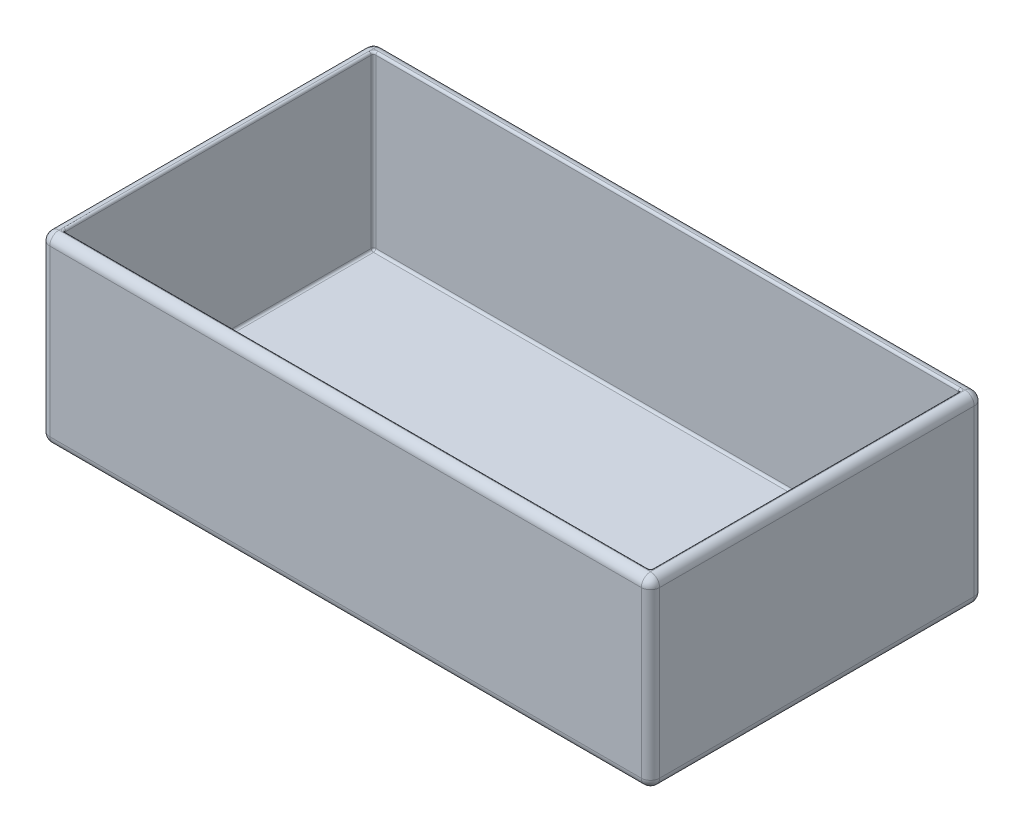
ISO-10303-21;
HEADER;
FILE_DESCRIPTION(('STEP AP214'),'2;1');
FILE_NAME('part.step','',(''),(''),'','','');
FILE_SCHEMA(('AUTOMOTIVE_DESIGN { 1 0 10303 214 1 1 1 1 }'));
ENDSEC;
DATA;
#1=APPLICATION_CONTEXT('core data for automotive mechanical design processes');
#2=APPLICATION_PROTOCOL_DEFINITION('international standard','automotive_design',2000,#1);
#3=PRODUCT_CONTEXT('',#1,'mechanical');
#4=PRODUCT('Part','Part','',(#3));
#5=PRODUCT_RELATED_PRODUCT_CATEGORY('part','',(#4));
#6=PRODUCT_DEFINITION_FORMATION('','',#4);
#7=PRODUCT_DEFINITION_CONTEXT('part definition',#1,'design');
#8=PRODUCT_DEFINITION('design','',#6,#7);
#9=PRODUCT_DEFINITION_SHAPE('','',#8);
#10=(LENGTH_UNIT() NAMED_UNIT(*) SI_UNIT(.MILLI.,.METRE.));
#11=(NAMED_UNIT(*) PLANE_ANGLE_UNIT() SI_UNIT($,.RADIAN.));
#12=(NAMED_UNIT(*) SI_UNIT($,.STERADIAN.) SOLID_ANGLE_UNIT());
#13=UNCERTAINTY_MEASURE_WITH_UNIT(LENGTH_MEASURE(1.E-05),#10,'distance_accuracy_value','');
#14=(GEOMETRIC_REPRESENTATION_CONTEXT(3) GLOBAL_UNCERTAINTY_ASSIGNED_CONTEXT((#13)) GLOBAL_UNIT_ASSIGNED_CONTEXT((#10,
#11,#12)) REPRESENTATION_CONTEXT('',''));
#15=CARTESIAN_POINT('',(0.,0.,0.));
#16=DIRECTION('',(0.,0.,1.));
#17=DIRECTION('',(1.,0.,0.));
#18=AXIS2_PLACEMENT_3D('',#15,#16,#17);
#19=CARTESIAN_POINT('',(0.,101.6,0.));
#20=DIRECTION('',(0.,1.,0.));
#21=DIRECTION('',(0.,0.,1.));
#22=AXIS2_PLACEMENT_3D('',#19,#20,#21);
#23=PLANE('',#22);
#24=CARTESIAN_POINT('',(-161.29,101.6,84.582));
#25=DIRECTION('',(0.,1.,0.));
#26=DIRECTION('',(0.,0.,1.));
#27=AXIS2_PLACEMENT_3D('',#24,#25,#26);
#28=CIRCLE('',#27,2.54);
#29=CARTESIAN_POINT('',(-163.83,101.6,84.582));
#30=VERTEX_POINT('',#29);
#31=CARTESIAN_POINT('',(-161.29,101.6,87.122));
#32=VERTEX_POINT('',#31);
#33=EDGE_CURVE('E290',#30,#32,#28,.T.);
#34=ORIENTED_EDGE('',*,*,#33,.F.);
#35=DIRECTION('',(0.,0.,1.));
#36=VECTOR('',#35,1.);
#37=CARTESIAN_POINT('',(-163.83,101.6,92.202));
#38=LINE('',#37,#36);
#39=CARTESIAN_POINT('',(-163.83,101.6,87.122));
#40=VERTEX_POINT('',#39);
#41=EDGE_CURVE('E252',#30,#40,#38,.T.);
#42=ORIENTED_EDGE('',*,*,#41,.T.);
#43=DIRECTION('',(1.,0.,0.));
#44=VECTOR('',#43,1.);
#45=CARTESIAN_POINT('',(168.91,101.6,87.122));
#46=LINE('',#45,#44);
#47=EDGE_CURVE('E255',#40,#32,#46,.T.);
#48=ORIENTED_EDGE('',*,*,#47,.T.);
#49=EDGE_LOOP('',(#34,#42,#48));
#50=FACE_BOUND('',#49,.T.);
#51=ADVANCED_FACE('F39',(#50),#23,.T.);
#52=CARTESIAN_POINT('',(161.29,101.6,84.582));
#53=DIRECTION('',(0.,1.,0.));
#54=DIRECTION('',(0.,0.,1.));
#55=AXIS2_PLACEMENT_3D('',#52,#53,#54);
#56=CIRCLE('',#55,2.54);
#57=CARTESIAN_POINT('',(161.29,101.6,87.122));
#58=VERTEX_POINT('',#57);
#59=CARTESIAN_POINT('',(163.83,101.6,84.582));
#60=VERTEX_POINT('',#59);
#61=EDGE_CURVE('E287',#58,#60,#56,.T.);
#62=ORIENTED_EDGE('',*,*,#61,.F.);
#63=CARTESIAN_POINT('',(163.83,101.6,87.122));
#64=VERTEX_POINT('',#63);
#65=EDGE_CURVE('E250',#58,#64,#46,.T.);
#66=ORIENTED_EDGE('',*,*,#65,.T.);
#67=DIRECTION('',(0.,0.,-1.));
#68=VECTOR('',#67,1.);
#69=CARTESIAN_POINT('',(163.83,101.6,-92.202));
#70=LINE('',#69,#68);
#71=EDGE_CURVE('E222',#64,#60,#70,.T.);
#72=ORIENTED_EDGE('',*,*,#71,.T.);
#73=EDGE_LOOP('',(#62,#66,#72));
#74=FACE_BOUND('',#73,.T.);
#75=ADVANCED_FACE('F624',(#74),#23,.T.);
#76=CARTESIAN_POINT('',(161.29,101.6,-84.582));
#77=DIRECTION('',(0.,1.,0.));
#78=DIRECTION('',(0.,0.,1.));
#79=AXIS2_PLACEMENT_3D('',#76,#77,#78);
#80=CIRCLE('',#79,2.54);
#81=CARTESIAN_POINT('',(163.83,101.6,-84.582));
#82=VERTEX_POINT('',#81);
#83=CARTESIAN_POINT('',(161.29,101.6,-87.122));
#84=VERTEX_POINT('',#83);
#85=EDGE_CURVE('E284',#82,#84,#80,.T.);
#86=ORIENTED_EDGE('',*,*,#85,.F.);
#87=CARTESIAN_POINT('',(163.83,101.6,-87.122));
#88=VERTEX_POINT('',#87);
#89=EDGE_CURVE('E645',#82,#88,#70,.T.);
#90=ORIENTED_EDGE('',*,*,#89,.T.);
#91=DIRECTION('',(-1.,0.,0.));
#92=VECTOR('',#91,1.);
#93=CARTESIAN_POINT('',(-168.91,101.6,-87.122));
#94=LINE('',#93,#92);
#95=EDGE_CURVE('E224',#88,#84,#94,.T.);
#96=ORIENTED_EDGE('',*,*,#95,.T.);
#97=EDGE_LOOP('',(#86,#90,#96));
#98=FACE_BOUND('',#97,.T.);
#99=ADVANCED_FACE('F630',(#98),#23,.T.);
#100=CARTESIAN_POINT('',(-161.29,101.6,-84.582));
#101=DIRECTION('',(0.,1.,0.));
#102=DIRECTION('',(0.,0.,1.));
#103=AXIS2_PLACEMENT_3D('',#100,#101,#102);
#104=CIRCLE('',#103,2.54);
#105=CARTESIAN_POINT('',(-161.29,101.6,-87.122));
#106=VERTEX_POINT('',#105);
#107=CARTESIAN_POINT('',(-163.83,101.6,-84.582));
#108=VERTEX_POINT('',#107);
#109=EDGE_CURVE('E218',#106,#108,#104,.T.);
#110=ORIENTED_EDGE('',*,*,#109,.F.);
#111=CARTESIAN_POINT('',(-163.83,101.6,-87.122));
#112=VERTEX_POINT('',#111);
#113=EDGE_CURVE('E212',#106,#112,#94,.T.);
#114=ORIENTED_EDGE('',*,*,#113,.T.);
#115=EDGE_CURVE('E216',#112,#108,#38,.T.);
#116=ORIENTED_EDGE('',*,*,#115,.T.);
#117=EDGE_LOOP('',(#110,#114,#116));
#118=FACE_BOUND('',#117,.T.);
#119=ADVANCED_FACE('F214',(#118),#23,.T.);
#120=CARTESIAN_POINT('',(168.91,101.6,-92.202));
#121=DIRECTION('',(-1.,0.,0.));
#122=DIRECTION('',(0.,0.,1.));
#123=AXIS2_PLACEMENT_3D('',#120,#121,#122);
#124=PLANE('',#123);
#125=DIRECTION('',(0.,-1.,0.));
#126=VECTOR('',#125,1.);
#127=CARTESIAN_POINT('',(168.91,101.6,-87.122));
#128=LINE('',#127,#126);
#129=CARTESIAN_POINT('',(168.91,5.08,-87.122));
#130=VERTEX_POINT('',#129);
#131=CARTESIAN_POINT('',(168.91,96.52,-87.122));
#132=VERTEX_POINT('',#131);
#133=EDGE_CURVE('E474',#130,#132,#128,.F.);
#134=ORIENTED_EDGE('',*,*,#133,.T.);
#135=DIRECTION('',(0.,0.,-1.));
#136=VECTOR('',#135,1.);
#137=CARTESIAN_POINT('',(168.91,96.52,92.202));
#138=LINE('',#137,#136);
#139=CARTESIAN_POINT('',(168.91,96.52,87.122));
#140=VERTEX_POINT('',#139);
#141=EDGE_CURVE('E476',#132,#140,#138,.F.);
#142=ORIENTED_EDGE('',*,*,#141,.T.);
#143=DIRECTION('',(0.,-1.,0.));
#144=VECTOR('',#143,1.);
#145=CARTESIAN_POINT('',(168.91,101.6,87.122));
#146=LINE('',#145,#144);
#147=CARTESIAN_POINT('',(168.91,5.08,87.122));
#148=VERTEX_POINT('',#147);
#149=EDGE_CURVE('E470',#140,#148,#146,.T.);
#150=ORIENTED_EDGE('',*,*,#149,.T.);
#151=DIRECTION('',(0.,0.,-1.));
#152=VECTOR('',#151,1.);
#153=CARTESIAN_POINT('',(168.91,5.08,-92.202));
#154=LINE('',#153,#152);
#155=EDGE_CURVE('E472',#148,#130,#154,.T.);
#156=ORIENTED_EDGE('',*,*,#155,.T.);
#157=EDGE_LOOP('',(#134,#142,#150,#156));
#158=FACE_BOUND('',#157,.T.);
#159=ADVANCED_FACE('F603',(#158),#124,.F.);
#160=CARTESIAN_POINT('',(-168.91,101.6,-92.202));
#161=DIRECTION('',(0.,0.,1.));
#162=DIRECTION('',(1.,0.,0.));
#163=AXIS2_PLACEMENT_3D('',#160,#161,#162);
#164=PLANE('',#163);
#165=DIRECTION('',(-1.,0.,0.));
#166=VECTOR('',#165,1.);
#167=CARTESIAN_POINT('',(168.91,96.52,-92.202));
#168=LINE('',#167,#166);
#169=CARTESIAN_POINT('',(-163.83,96.52,-92.202));
#170=VERTEX_POINT('',#169);
#171=CARTESIAN_POINT('',(163.83,96.52,-92.202));
#172=VERTEX_POINT('',#171);
#173=EDGE_CURVE('E231',#170,#172,#168,.F.);
#174=ORIENTED_EDGE('',*,*,#173,.T.);
#175=DIRECTION('',(0.,-1.,0.));
#176=VECTOR('',#175,1.);
#177=CARTESIAN_POINT('',(163.83,101.6,-92.202));
#178=LINE('',#177,#176);
#179=CARTESIAN_POINT('',(163.83,5.08,-92.202));
#180=VERTEX_POINT('',#179);
#181=EDGE_CURVE('E459',#172,#180,#178,.T.);
#182=ORIENTED_EDGE('',*,*,#181,.T.);
#183=DIRECTION('',(-1.,0.,0.));
#184=VECTOR('',#183,1.);
#185=CARTESIAN_POINT('',(-168.91,5.08,-92.202));
#186=LINE('',#185,#184);
#187=CARTESIAN_POINT('',(-163.83,5.08,-92.202));
#188=VERTEX_POINT('',#187);
#189=EDGE_CURVE('E456',#180,#188,#186,.T.);
#190=ORIENTED_EDGE('',*,*,#189,.T.);
#191=DIRECTION('',(0.,-1.,0.));
#192=VECTOR('',#191,1.);
#193=CARTESIAN_POINT('',(-163.83,101.6,-92.202));
#194=LINE('',#193,#192);
#195=EDGE_CURVE('E452',#188,#170,#194,.F.);
#196=ORIENTED_EDGE('',*,*,#195,.T.);
#197=EDGE_LOOP('',(#174,#182,#190,#196));
#198=FACE_BOUND('',#197,.T.);
#199=ADVANCED_FACE('F640',(#198),#164,.F.);
#200=CARTESIAN_POINT('',(-168.91,101.6,-92.202));
#201=DIRECTION('',(1.,0.,0.));
#202=DIRECTION('',(0.,0.,-1.));
#203=AXIS2_PLACEMENT_3D('',#200,#201,#202);
#204=PLANE('',#203);
#205=DIRECTION('',(0.,0.,1.));
#206=VECTOR('',#205,1.);
#207=CARTESIAN_POINT('',(-168.91,96.52,-92.202));
#208=LINE('',#207,#206);
#209=CARTESIAN_POINT('',(-168.91,96.52,87.122));
#210=VERTEX_POINT('',#209);
#211=CARTESIAN_POINT('',(-168.91,96.52,-87.122));
#212=VERTEX_POINT('',#211);
#213=EDGE_CURVE('E492',#210,#212,#208,.F.);
#214=ORIENTED_EDGE('',*,*,#213,.T.);
#215=DIRECTION('',(0.,-1.,0.));
#216=VECTOR('',#215,1.);
#217=CARTESIAN_POINT('',(-168.91,101.6,-87.122));
#218=LINE('',#217,#216);
#219=CARTESIAN_POINT('',(-168.91,5.08,-87.122));
#220=VERTEX_POINT('',#219);
#221=EDGE_CURVE('E276',#212,#220,#218,.T.);
#222=ORIENTED_EDGE('',*,*,#221,.T.);
#223=DIRECTION('',(0.,0.,1.));
#224=VECTOR('',#223,1.);
#225=CARTESIAN_POINT('',(-168.91,5.08,-92.202));
#226=LINE('',#225,#224);
#227=CARTESIAN_POINT('',(-168.91,5.08,87.122));
#228=VERTEX_POINT('',#227);
#229=EDGE_CURVE('E488',#220,#228,#226,.T.);
#230=ORIENTED_EDGE('',*,*,#229,.T.);
#231=DIRECTION('',(0.,-1.,0.));
#232=VECTOR('',#231,1.);
#233=CARTESIAN_POINT('',(-168.91,101.6,87.122));
#234=LINE('',#233,#232);
#235=EDGE_CURVE('E490',#228,#210,#234,.F.);
#236=ORIENTED_EDGE('',*,*,#235,.T.);
#237=EDGE_LOOP('',(#214,#222,#230,#236));
#238=FACE_BOUND('',#237,.T.);
#239=ADVANCED_FACE('F687',(#238),#204,.F.);
#240=CARTESIAN_POINT('',(-168.91,101.6,92.202));
#241=DIRECTION('',(0.,0.,-1.));
#242=DIRECTION('',(-1.,0.,0.));
#243=AXIS2_PLACEMENT_3D('',#240,#241,#242);
#244=PLANE('',#243);
#245=DIRECTION('',(0.,-1.,0.));
#246=VECTOR('',#245,1.);
#247=CARTESIAN_POINT('',(163.83,101.6,92.202));
#248=LINE('',#247,#246);
#249=CARTESIAN_POINT('',(163.83,5.08,92.202));
#250=VERTEX_POINT('',#249);
#251=CARTESIAN_POINT('',(163.83,96.52,92.202));
#252=VERTEX_POINT('',#251);
#253=EDGE_CURVE('E483',#250,#252,#248,.F.);
#254=ORIENTED_EDGE('',*,*,#253,.T.);
#255=DIRECTION('',(1.,0.,0.));
#256=VECTOR('',#255,1.);
#257=CARTESIAN_POINT('',(-168.91,96.52,92.202));
#258=LINE('',#257,#256);
#259=CARTESIAN_POINT('',(-163.83,96.52,92.202));
#260=VERTEX_POINT('',#259);
#261=EDGE_CURVE('E485',#252,#260,#258,.F.);
#262=ORIENTED_EDGE('',*,*,#261,.T.);
#263=DIRECTION('',(0.,-1.,0.));
#264=VECTOR('',#263,1.);
#265=CARTESIAN_POINT('',(-163.83,101.6,92.202));
#266=LINE('',#265,#264);
#267=CARTESIAN_POINT('',(-163.83,5.08,92.202));
#268=VERTEX_POINT('',#267);
#269=EDGE_CURVE('E479',#260,#268,#266,.T.);
#270=ORIENTED_EDGE('',*,*,#269,.T.);
#271=DIRECTION('',(1.,0.,0.));
#272=VECTOR('',#271,1.);
#273=CARTESIAN_POINT('',(-168.91,5.08,92.202));
#274=LINE('',#273,#272);
#275=EDGE_CURVE('E481',#268,#250,#274,.T.);
#276=ORIENTED_EDGE('',*,*,#275,.T.);
#277=EDGE_LOOP('',(#254,#262,#270,#276));
#278=FACE_BOUND('',#277,.T.);
#279=ADVANCED_FACE('F555',(#278),#244,.F.);
#280=CARTESIAN_POINT('',(0.,0.,0.));
#281=DIRECTION('',(0.,1.,0.));
#282=DIRECTION('',(0.,0.,1.));
#283=AXIS2_PLACEMENT_3D('',#280,#281,#282);
#284=PLANE('',#283);
#285=DIRECTION('',(0.,0.,1.));
#286=VECTOR('',#285,1.);
#287=CARTESIAN_POINT('',(-163.83,0.,0.));
#288=LINE('',#287,#286);
#289=CARTESIAN_POINT('',(-163.83,0.,87.122));
#290=VERTEX_POINT('',#289);
#291=CARTESIAN_POINT('',(-163.83,0.,-87.122));
#292=VERTEX_POINT('',#291);
#293=EDGE_CURVE('E461',#290,#292,#288,.F.);
#294=ORIENTED_EDGE('',*,*,#293,.T.);
#295=DIRECTION('',(-1.,0.,0.));
#296=VECTOR('',#295,1.);
#297=CARTESIAN_POINT('',(0.,0.,-87.122));
#298=LINE('',#297,#296);
#299=CARTESIAN_POINT('',(163.83,0.,-87.122));
#300=VERTEX_POINT('',#299);
#301=EDGE_CURVE('E467',#292,#300,#298,.F.);
#302=ORIENTED_EDGE('',*,*,#301,.T.);
#303=DIRECTION('',(0.,0.,-1.));
#304=VECTOR('',#303,1.);
#305=CARTESIAN_POINT('',(163.83,0.,0.));
#306=LINE('',#305,#304);
#307=CARTESIAN_POINT('',(163.83,0.,87.122));
#308=VERTEX_POINT('',#307);
#309=EDGE_CURVE('E465',#300,#308,#306,.F.);
#310=ORIENTED_EDGE('',*,*,#309,.T.);
#311=DIRECTION('',(1.,0.,0.));
#312=VECTOR('',#311,1.);
#313=CARTESIAN_POINT('',(0.,0.,87.122));
#314=LINE('',#313,#312);
#315=EDGE_CURVE('E463',#308,#290,#314,.F.);
#316=ORIENTED_EDGE('',*,*,#315,.T.);
#317=EDGE_LOOP('',(#294,#302,#310,#316));
#318=FACE_BOUND('',#317,.T.);
#319=ADVANCED_FACE('F586',(#318),#284,.F.);
#320=CARTESIAN_POINT('',(162.56,101.6,-92.202));
#321=DIRECTION('',(-1.,0.,0.));
#322=DIRECTION('',(0.,0.,1.));
#323=AXIS2_PLACEMENT_3D('',#320,#321,#322);
#324=PLANE('',#323);
#325=DIRECTION('',(0.,-1.,0.));
#326=VECTOR('',#325,1.);
#327=CARTESIAN_POINT('',(162.56,101.6,84.582));
#328=LINE('',#327,#326);
#329=CARTESIAN_POINT('',(162.56,7.62,84.582));
#330=VERTEX_POINT('',#329);
#331=CARTESIAN_POINT('',(162.56,100.33,84.582));
#332=VERTEX_POINT('',#331);
#333=EDGE_CURVE('E297',#330,#332,#328,.F.);
#334=ORIENTED_EDGE('',*,*,#333,.T.);
#335=DIRECTION('',(0.,0.,-1.));
#336=VECTOR('',#335,1.);
#337=CARTESIAN_POINT('',(162.56,100.33,-92.202));
#338=LINE('',#337,#336);
#339=CARTESIAN_POINT('',(162.56,100.33,-84.582));
#340=VERTEX_POINT('',#339);
#341=EDGE_CURVE('E299',#332,#340,#338,.T.);
#342=ORIENTED_EDGE('',*,*,#341,.T.);
#343=DIRECTION('',(0.,-1.,0.));
#344=VECTOR('',#343,1.);
#345=CARTESIAN_POINT('',(162.56,6.34999999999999,-84.582));
#346=LINE('',#345,#344);
#347=CARTESIAN_POINT('',(162.56,7.62,-84.582));
#348=VERTEX_POINT('',#347);
#349=EDGE_CURVE('E295',#340,#348,#346,.T.);
#350=ORIENTED_EDGE('',*,*,#349,.T.);
#351=DIRECTION('',(0.,0.,-1.));
#352=VECTOR('',#351,1.);
#353=CARTESIAN_POINT('',(162.56,7.62,85.852));
#354=LINE('',#353,#352);
#355=EDGE_CURVE('E293',#348,#330,#354,.F.);
#356=ORIENTED_EDGE('',*,*,#355,.T.);
#357=EDGE_LOOP('',(#334,#342,#350,#356));
#358=FACE_BOUND('',#357,.T.);
#359=ADVANCED_FACE('F678',(#358),#324,.T.);
#360=CARTESIAN_POINT('',(-168.91,101.6,-85.852));
#361=DIRECTION('',(0.,0.,1.));
#362=DIRECTION('',(1.,0.,0.));
#363=AXIS2_PLACEMENT_3D('',#360,#361,#362);
#364=PLANE('',#363);
#365=DIRECTION('',(0.,-1.,0.));
#366=VECTOR('',#365,1.);
#367=CARTESIAN_POINT('',(161.29,101.6,-85.852));
#368=LINE('',#367,#366);
#369=CARTESIAN_POINT('',(161.29,7.62,-85.852));
#370=VERTEX_POINT('',#369);
#371=CARTESIAN_POINT('',(161.29,100.33,-85.852));
#372=VERTEX_POINT('',#371);
#373=EDGE_CURVE('E306',#370,#372,#368,.F.);
#374=ORIENTED_EDGE('',*,*,#373,.T.);
#375=DIRECTION('',(-1.,0.,0.));
#376=VECTOR('',#375,1.);
#377=CARTESIAN_POINT('',(-168.91,100.33,-85.852));
#378=LINE('',#377,#376);
#379=CARTESIAN_POINT('',(-161.29,100.33,-85.852));
#380=VERTEX_POINT('',#379);
#381=EDGE_CURVE('E308',#372,#380,#378,.T.);
#382=ORIENTED_EDGE('',*,*,#381,.T.);
#383=DIRECTION('',(0.,-1.,0.));
#384=VECTOR('',#383,1.);
#385=CARTESIAN_POINT('',(-161.29,6.34999999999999,-85.852));
#386=LINE('',#385,#384);
#387=CARTESIAN_POINT('',(-161.29,7.62,-85.852));
#388=VERTEX_POINT('',#387);
#389=EDGE_CURVE('E302',#380,#388,#386,.T.);
#390=ORIENTED_EDGE('',*,*,#389,.T.);
#391=DIRECTION('',(-1.,0.,0.));
#392=VECTOR('',#391,1.);
#393=CARTESIAN_POINT('',(162.56,7.62,-85.852));
#394=LINE('',#393,#392);
#395=EDGE_CURVE('E304',#388,#370,#394,.F.);
#396=ORIENTED_EDGE('',*,*,#395,.T.);
#397=EDGE_LOOP('',(#374,#382,#390,#396));
#398=FACE_BOUND('',#397,.T.);
#399=ADVANCED_FACE('F446',(#398),#364,.T.);
#400=CARTESIAN_POINT('',(-162.56,101.6,-92.202));
#401=DIRECTION('',(1.,0.,0.));
#402=DIRECTION('',(0.,0.,-1.));
#403=AXIS2_PLACEMENT_3D('',#400,#401,#402);
#404=PLANE('',#403);
#405=DIRECTION('',(0.,0.,1.));
#406=VECTOR('',#405,1.);
#407=CARTESIAN_POINT('',(-162.56,100.33,-92.202));
#408=LINE('',#407,#406);
#409=CARTESIAN_POINT('',(-162.56,100.33,-84.582));
#410=VERTEX_POINT('',#409);
#411=CARTESIAN_POINT('',(-162.56,100.33,84.582));
#412=VERTEX_POINT('',#411);
#413=EDGE_CURVE('E48',#410,#412,#408,.T.);
#414=ORIENTED_EDGE('',*,*,#413,.T.);
#415=DIRECTION('',(0.,-1.,0.));
#416=VECTOR('',#415,1.);
#417=CARTESIAN_POINT('',(-162.56,6.34999999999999,84.582));
#418=LINE('',#417,#416);
#419=CARTESIAN_POINT('',(-162.56,7.62,84.582));
#420=VERTEX_POINT('',#419);
#421=EDGE_CURVE('E11',#412,#420,#418,.T.);
#422=ORIENTED_EDGE('',*,*,#421,.T.);
#423=DIRECTION('',(0.,0.,1.));
#424=VECTOR('',#423,1.);
#425=CARTESIAN_POINT('',(-162.56,7.62,-85.852));
#426=LINE('',#425,#424);
#427=CARTESIAN_POINT('',(-162.56,7.62,-84.582));
#428=VERTEX_POINT('',#427);
#429=EDGE_CURVE('E320',#420,#428,#426,.F.);
#430=ORIENTED_EDGE('',*,*,#429,.T.);
#431=DIRECTION('',(0.,-1.,0.));
#432=VECTOR('',#431,1.);
#433=CARTESIAN_POINT('',(-162.56,101.6,-84.582));
#434=LINE('',#433,#432);
#435=EDGE_CURVE('E59',#428,#410,#434,.F.);
#436=ORIENTED_EDGE('',*,*,#435,.T.);
#437=EDGE_LOOP('',(#414,#422,#430,#436));
#438=FACE_BOUND('',#437,.T.);
#439=ADVANCED_FACE('F418',(#438),#404,.T.);
#440=CARTESIAN_POINT('',(-168.91,101.6,85.852));
#441=DIRECTION('',(0.,0.,-1.));
#442=DIRECTION('',(-1.,0.,0.));
#443=AXIS2_PLACEMENT_3D('',#440,#441,#442);
#444=PLANE('',#443);
#445=DIRECTION('',(0.,-1.,0.));
#446=VECTOR('',#445,1.);
#447=CARTESIAN_POINT('',(-161.29,101.6,85.852));
#448=LINE('',#447,#446);
#449=CARTESIAN_POINT('',(-161.29,7.62,85.852));
#450=VERTEX_POINT('',#449);
#451=CARTESIAN_POINT('',(-161.29,100.33,85.852));
#452=VERTEX_POINT('',#451);
#453=EDGE_CURVE('E273',#450,#452,#448,.F.);
#454=ORIENTED_EDGE('',*,*,#453,.T.);
#455=DIRECTION('',(1.,0.,0.));
#456=VECTOR('',#455,1.);
#457=CARTESIAN_POINT('',(-168.91,100.33,85.852));
#458=LINE('',#457,#456);
#459=CARTESIAN_POINT('',(161.29,100.33,85.852));
#460=VERTEX_POINT('',#459);
#461=EDGE_CURVE('E280',#452,#460,#458,.T.);
#462=ORIENTED_EDGE('',*,*,#461,.T.);
#463=DIRECTION('',(0.,-1.,0.));
#464=VECTOR('',#463,1.);
#465=CARTESIAN_POINT('',(161.29,6.34999999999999,85.852));
#466=LINE('',#465,#464);
#467=CARTESIAN_POINT('',(161.29,7.62,85.852));
#468=VERTEX_POINT('',#467);
#469=EDGE_CURVE('E278',#460,#468,#466,.T.);
#470=ORIENTED_EDGE('',*,*,#469,.T.);
#471=DIRECTION('',(1.,0.,0.));
#472=VECTOR('',#471,1.);
#473=CARTESIAN_POINT('',(-162.56,7.62,85.852));
#474=LINE('',#473,#472);
#475=EDGE_CURVE('E275',#468,#450,#474,.F.);
#476=ORIENTED_EDGE('',*,*,#475,.T.);
#477=EDGE_LOOP('',(#454,#462,#470,#476));
#478=FACE_BOUND('',#477,.T.);
#479=ADVANCED_FACE('F667',(#478),#444,.T.);
#480=CARTESIAN_POINT('',(0.,6.35,0.));
#481=DIRECTION('',(0.,1.,0.));
#482=DIRECTION('',(0.,0.,1.));
#483=AXIS2_PLACEMENT_3D('',#480,#481,#482);
#484=PLANE('',#483);
#485=DIRECTION('',(1.,0.,0.));
#486=VECTOR('',#485,1.);
#487=CARTESIAN_POINT('',(162.56,6.35,84.582));
#488=LINE('',#487,#486);
#489=CARTESIAN_POINT('',(-161.29,6.35,84.582));
#490=VERTEX_POINT('',#489);
#491=CARTESIAN_POINT('',(161.29,6.35,84.582));
#492=VERTEX_POINT('',#491);
#493=EDGE_CURVE('E315',#490,#492,#488,.T.);
#494=ORIENTED_EDGE('',*,*,#493,.T.);
#495=DIRECTION('',(0.,0.,-1.));
#496=VECTOR('',#495,1.);
#497=CARTESIAN_POINT('',(161.29,6.35,-85.852));
#498=LINE('',#497,#496);
#499=CARTESIAN_POINT('',(161.29,6.35,-84.582));
#500=VERTEX_POINT('',#499);
#501=EDGE_CURVE('E318',#492,#500,#498,.T.);
#502=ORIENTED_EDGE('',*,*,#501,.T.);
#503=DIRECTION('',(-1.,0.,0.));
#504=VECTOR('',#503,1.);
#505=CARTESIAN_POINT('',(-162.56,6.35,-84.582));
#506=LINE('',#505,#504);
#507=CARTESIAN_POINT('',(-161.29,6.35,-84.582));
#508=VERTEX_POINT('',#507);
#509=EDGE_CURVE('E313',#500,#508,#506,.T.);
#510=ORIENTED_EDGE('',*,*,#509,.T.);
#511=DIRECTION('',(0.,0.,1.));
#512=VECTOR('',#511,1.);
#513=CARTESIAN_POINT('',(-161.29,6.35,85.852));
#514=LINE('',#513,#512);
#515=EDGE_CURVE('E311',#508,#490,#514,.T.);
#516=ORIENTED_EDGE('',*,*,#515,.T.);
#517=EDGE_LOOP('',(#494,#502,#510,#516));
#518=FACE_BOUND('',#517,.T.);
#519=ADVANCED_FACE('F425',(#518),#484,.T.);
#520=CARTESIAN_POINT('',(-168.91,5.08,87.122));
#521=DIRECTION('',(1.,0.,0.));
#522=DIRECTION('',(0.,0.,-1.));
#523=AXIS2_PLACEMENT_3D('',#520,#521,#522);
#524=CYLINDRICAL_SURFACE('',#523,5.08);
#525=CARTESIAN_POINT('',(163.83,5.08,87.122));
#526=DIRECTION('',(1.,0.,0.));
#527=DIRECTION('',(0.,0.,-1.));
#528=AXIS2_PLACEMENT_3D('',#525,#526,#527);
#529=CIRCLE('',#528,5.08);
#530=EDGE_CURVE('E256',#250,#308,#529,.T.);
#531=ORIENTED_EDGE('',*,*,#530,.F.);
#532=ORIENTED_EDGE('',*,*,#275,.F.);
#533=CARTESIAN_POINT('',(-163.83,5.08,87.122));
#534=DIRECTION('',(-1.,0.,0.));
#535=DIRECTION('',(0.,0.,1.));
#536=AXIS2_PLACEMENT_3D('',#533,#534,#535);
#537=CIRCLE('',#536,5.08);
#538=EDGE_CURVE('E261',#290,#268,#537,.T.);
#539=ORIENTED_EDGE('',*,*,#538,.F.);
#540=ORIENTED_EDGE('',*,*,#315,.F.);
#541=EDGE_LOOP('',(#531,#532,#539,#540));
#542=FACE_BOUND('',#541,.T.);
#543=ADVANCED_FACE('F574',(#542),#524,.T.);
#544=CARTESIAN_POINT('',(163.83,5.08,87.122));
#545=DIRECTION('',(0.,-1.,0.));
#546=DIRECTION('',(0.,0.,-1.));
#547=AXIS2_PLACEMENT_3D('',#544,#545,#546);
#548=SPHERICAL_SURFACE('',#547,5.08);
#549=CARTESIAN_POINT('',(163.83,5.08,87.122));
#550=DIRECTION('',(0.,-1.,0.));
#551=DIRECTION('',(0.,0.,-1.));
#552=AXIS2_PLACEMENT_3D('',#549,#550,#551);
#553=CIRCLE('',#552,5.08);
#554=EDGE_CURVE('E540',#250,#148,#553,.F.);
#555=ORIENTED_EDGE('',*,*,#554,.F.);
#556=ORIENTED_EDGE('',*,*,#530,.T.);
#557=CARTESIAN_POINT('',(163.83,5.08,87.122));
#558=DIRECTION('',(0.,0.,1.));
#559=DIRECTION('',(1.,0.,0.));
#560=AXIS2_PLACEMENT_3D('',#557,#558,#559);
#561=CIRCLE('',#560,5.08);
#562=EDGE_CURVE('E269',#148,#308,#561,.F.);
#563=ORIENTED_EDGE('',*,*,#562,.F.);
#564=EDGE_LOOP('',(#555,#556,#563));
#565=FACE_BOUND('',#564,.T.);
#566=ADVANCED_FACE('F547',(#565),#548,.T.);
#567=CARTESIAN_POINT('',(-163.83,5.08,87.122));
#568=DIRECTION('',(0.,0.,1.));
#569=DIRECTION('',(0.,-1.,0.));
#570=AXIS2_PLACEMENT_3D('',#567,#568,#569);
#571=SPHERICAL_SURFACE('',#570,5.08);
#572=CARTESIAN_POINT('',(-163.83,5.08,87.122));
#573=DIRECTION('',(0.,0.,1.));
#574=DIRECTION('',(1.,0.,0.));
#575=AXIS2_PLACEMENT_3D('',#572,#573,#574);
#576=CIRCLE('',#575,5.08);
#577=EDGE_CURVE('E534',#290,#228,#576,.F.);
#578=ORIENTED_EDGE('',*,*,#577,.F.);
#579=ORIENTED_EDGE('',*,*,#538,.T.);
#580=CARTESIAN_POINT('',(-163.83,5.08,87.122));
#581=DIRECTION('',(0.,-1.,0.));
#582=DIRECTION('',(0.,0.,-1.));
#583=AXIS2_PLACEMENT_3D('',#580,#581,#582);
#584=CIRCLE('',#583,5.08);
#585=EDGE_CURVE('E537',#228,#268,#584,.F.);
#586=ORIENTED_EDGE('',*,*,#585,.F.);
#587=EDGE_LOOP('',(#578,#579,#586));
#588=FACE_BOUND('',#587,.T.);
#589=ADVANCED_FACE('F578',(#588),#571,.T.);
#590=CARTESIAN_POINT('',(163.83,5.08,-92.202));
#591=DIRECTION('',(0.,0.,-1.));
#592=DIRECTION('',(-1.,0.,0.));
#593=AXIS2_PLACEMENT_3D('',#590,#591,#592);
#594=CYLINDRICAL_SURFACE('',#593,5.08);
#595=ORIENTED_EDGE('',*,*,#562,.T.);
#596=ORIENTED_EDGE('',*,*,#309,.F.);
#597=CARTESIAN_POINT('',(163.83,5.08,-87.122));
#598=DIRECTION('',(0.,0.,-1.));
#599=DIRECTION('',(-1.,0.,0.));
#600=AXIS2_PLACEMENT_3D('',#597,#598,#599);
#601=CIRCLE('',#600,5.08);
#602=EDGE_CURVE('E529',#130,#300,#601,.T.);
#603=ORIENTED_EDGE('',*,*,#602,.F.);
#604=ORIENTED_EDGE('',*,*,#155,.F.);
#605=EDGE_LOOP('',(#595,#596,#603,#604));
#606=FACE_BOUND('',#605,.T.);
#607=ADVANCED_FACE('F545',(#606),#594,.T.);
#608=CARTESIAN_POINT('',(163.83,101.6,87.122));
#609=DIRECTION('',(0.,-1.,0.));
#610=DIRECTION('',(0.,0.,-1.));
#611=AXIS2_PLACEMENT_3D('',#608,#609,#610);
#612=CYLINDRICAL_SURFACE('',#611,5.08);
#613=ORIENTED_EDGE('',*,*,#554,.T.);
#614=ORIENTED_EDGE('',*,*,#149,.F.);
#615=CARTESIAN_POINT('',(163.83,96.52,87.122));
#616=DIRECTION('',(0.,1.,0.));
#617=DIRECTION('',(0.,0.,1.));
#618=AXIS2_PLACEMENT_3D('',#615,#616,#617);
#619=CIRCLE('',#618,5.08);
#620=EDGE_CURVE('E526',#252,#140,#619,.T.);
#621=ORIENTED_EDGE('',*,*,#620,.F.);
#622=ORIENTED_EDGE('',*,*,#253,.F.);
#623=EDGE_LOOP('',(#613,#614,#621,#622));
#624=FACE_BOUND('',#623,.T.);
#625=ADVANCED_FACE('F552',(#624),#612,.T.);
#626=CARTESIAN_POINT('',(0.,96.52,87.122));
#627=DIRECTION('',(-1.,0.,0.));
#628=DIRECTION('',(0.,0.,1.));
#629=AXIS2_PLACEMENT_3D('',#626,#627,#628);
#630=CYLINDRICAL_SURFACE('',#629,5.08);
#631=CARTESIAN_POINT('',(-163.83,96.52,87.122));
#632=DIRECTION('',(-1.,0.,0.));
#633=DIRECTION('',(0.,0.,1.));
#634=AXIS2_PLACEMENT_3D('',#631,#632,#633);
#635=CIRCLE('',#634,5.08);
#636=EDGE_CURVE('E520',#260,#40,#635,.T.);
#637=ORIENTED_EDGE('',*,*,#636,.F.);
#638=ORIENTED_EDGE('',*,*,#261,.F.);
#639=CARTESIAN_POINT('',(163.83,96.52,87.122));
#640=DIRECTION('',(1.,0.,0.));
#641=DIRECTION('',(0.,0.,-1.));
#642=AXIS2_PLACEMENT_3D('',#639,#640,#641);
#643=CIRCLE('',#642,5.08);
#644=EDGE_CURVE('E523',#64,#252,#643,.T.);
#645=ORIENTED_EDGE('',*,*,#644,.F.);
#646=ORIENTED_EDGE('',*,*,#65,.F.);
#647=EDGE_CURVE('E253',#32,#58,#46,.T.);
#648=ORIENTED_EDGE('',*,*,#647,.F.);
#649=ORIENTED_EDGE('',*,*,#47,.F.);
#650=EDGE_LOOP('',(#637,#638,#645,#646,#648,#649));
#651=FACE_BOUND('',#650,.T.);
#652=ADVANCED_FACE('F560',(#651),#630,.T.);
#653=CARTESIAN_POINT('',(-163.83,101.6,87.122));
#654=DIRECTION('',(0.,-1.,0.));
#655=DIRECTION('',(0.,0.,-1.));
#656=AXIS2_PLACEMENT_3D('',#653,#654,#655);
#657=CYLINDRICAL_SURFACE('',#656,5.08);
#658=ORIENTED_EDGE('',*,*,#585,.T.);
#659=ORIENTED_EDGE('',*,*,#269,.F.);
#660=CARTESIAN_POINT('',(-163.83,96.52,87.122));
#661=DIRECTION('',(0.,1.,0.));
#662=DIRECTION('',(0.,0.,1.));
#663=AXIS2_PLACEMENT_3D('',#660,#661,#662);
#664=CIRCLE('',#663,5.08);
#665=EDGE_CURVE('E518',#210,#260,#664,.T.);
#666=ORIENTED_EDGE('',*,*,#665,.F.);
#667=ORIENTED_EDGE('',*,*,#235,.F.);
#668=EDGE_LOOP('',(#658,#659,#666,#667));
#669=FACE_BOUND('',#668,.T.);
#670=ADVANCED_FACE('F569',(#669),#657,.T.);
#671=CARTESIAN_POINT('',(-163.83,5.08,-92.202));
#672=DIRECTION('',(0.,0.,1.));
#673=DIRECTION('',(1.,0.,0.));
#674=AXIS2_PLACEMENT_3D('',#671,#672,#673);
#675=CYLINDRICAL_SURFACE('',#674,5.08);
#676=ORIENTED_EDGE('',*,*,#577,.T.);
#677=ORIENTED_EDGE('',*,*,#229,.F.);
#678=CARTESIAN_POINT('',(-163.83,5.08,-87.122));
#679=DIRECTION('',(0.,0.,-1.));
#680=DIRECTION('',(-1.,0.,0.));
#681=AXIS2_PLACEMENT_3D('',#678,#679,#680);
#682=CIRCLE('',#681,5.08);
#683=EDGE_CURVE('E515',#292,#220,#682,.T.);
#684=ORIENTED_EDGE('',*,*,#683,.F.);
#685=ORIENTED_EDGE('',*,*,#293,.F.);
#686=EDGE_LOOP('',(#676,#677,#684,#685));
#687=FACE_BOUND('',#686,.T.);
#688=ADVANCED_FACE('F583',(#687),#675,.T.);
#689=CARTESIAN_POINT('',(-168.91,5.08,-87.122));
#690=DIRECTION('',(-1.,0.,0.));
#691=DIRECTION('',(0.,0.,1.));
#692=AXIS2_PLACEMENT_3D('',#689,#690,#691);
#693=CYLINDRICAL_SURFACE('',#692,5.08);
#694=CARTESIAN_POINT('',(163.83,5.08,-87.122));
#695=DIRECTION('',(1.,0.,0.));
#696=DIRECTION('',(0.,0.,-1.));
#697=AXIS2_PLACEMENT_3D('',#694,#695,#696);
#698=CIRCLE('',#697,5.08);
#699=EDGE_CURVE('E531',#300,#180,#698,.T.);
#700=ORIENTED_EDGE('',*,*,#699,.F.);
#701=ORIENTED_EDGE('',*,*,#301,.F.);
#702=CARTESIAN_POINT('',(-163.83,5.08,-87.122));
#703=DIRECTION('',(-1.,0.,0.));
#704=DIRECTION('',(0.,0.,1.));
#705=AXIS2_PLACEMENT_3D('',#702,#703,#704);
#706=CIRCLE('',#705,5.08);
#707=EDGE_CURVE('E512',#188,#292,#706,.T.);
#708=ORIENTED_EDGE('',*,*,#707,.F.);
#709=ORIENTED_EDGE('',*,*,#189,.F.);
#710=EDGE_LOOP('',(#700,#701,#708,#709));
#711=FACE_BOUND('',#710,.T.);
#712=ADVANCED_FACE('F590',(#711),#693,.T.);
#713=CARTESIAN_POINT('',(163.83,5.08,-87.122));
#714=DIRECTION('',(0.,-1.,0.));
#715=DIRECTION('',(0.,0.,-1.));
#716=AXIS2_PLACEMENT_3D('',#713,#714,#715);
#717=SPHERICAL_SURFACE('',#716,5.08);
#718=ORIENTED_EDGE('',*,*,#602,.T.);
#719=ORIENTED_EDGE('',*,*,#699,.T.);
#720=CARTESIAN_POINT('',(163.83,5.08,-87.122));
#721=DIRECTION('',(0.,-1.,0.));
#722=DIRECTION('',(0.,0.,-1.));
#723=AXIS2_PLACEMENT_3D('',#720,#721,#722);
#724=CIRCLE('',#723,5.08);
#725=EDGE_CURVE('E509',#130,#180,#724,.F.);
#726=ORIENTED_EDGE('',*,*,#725,.F.);
#727=EDGE_LOOP('',(#718,#719,#726));
#728=FACE_BOUND('',#727,.T.);
#729=ADVANCED_FACE('F595',(#728),#717,.T.);
#730=CARTESIAN_POINT('',(163.83,96.52,87.122));
#731=DIRECTION('',(0.,0.,1.));
#732=DIRECTION('',(1.,0.,0.));
#733=AXIS2_PLACEMENT_3D('',#730,#731,#732);
#734=SPHERICAL_SURFACE('',#733,5.08);
#735=ORIENTED_EDGE('',*,*,#644,.T.);
#736=ORIENTED_EDGE('',*,*,#620,.T.);
#737=CARTESIAN_POINT('',(163.83,96.52,87.122));
#738=DIRECTION('',(0.,0.,1.));
#739=DIRECTION('',(1.,0.,0.));
#740=AXIS2_PLACEMENT_3D('',#737,#738,#739);
#741=CIRCLE('',#740,5.08);
#742=EDGE_CURVE('E507',#64,#140,#741,.F.);
#743=ORIENTED_EDGE('',*,*,#742,.F.);
#744=EDGE_LOOP('',(#735,#736,#743));
#745=FACE_BOUND('',#744,.T.);
#746=ADVANCED_FACE('F612',(#745),#734,.T.);
#747=CARTESIAN_POINT('',(-163.83,96.52,87.122));
#748=DIRECTION('',(0.,0.,1.));
#749=DIRECTION('',(1.,0.,0.));
#750=AXIS2_PLACEMENT_3D('',#747,#748,#749);
#751=SPHERICAL_SURFACE('',#750,5.08);
#752=ORIENTED_EDGE('',*,*,#665,.T.);
#753=ORIENTED_EDGE('',*,*,#636,.T.);
#754=CARTESIAN_POINT('',(-163.83,96.52,87.122));
#755=DIRECTION('',(0.,0.,1.));
#756=DIRECTION('',(1.,0.,0.));
#757=AXIS2_PLACEMENT_3D('',#754,#755,#756);
#758=CIRCLE('',#757,5.08);
#759=EDGE_CURVE('E505',#210,#40,#758,.F.);
#760=ORIENTED_EDGE('',*,*,#759,.F.);
#761=EDGE_LOOP('',(#752,#753,#760));
#762=FACE_BOUND('',#761,.T.);
#763=ADVANCED_FACE('F614',(#762),#751,.T.);
#764=CARTESIAN_POINT('',(-163.83,5.08,-87.122));
#765=DIRECTION('',(0.,-1.,0.));
#766=DIRECTION('',(0.,0.,-1.));
#767=AXIS2_PLACEMENT_3D('',#764,#765,#766);
#768=SPHERICAL_SURFACE('',#767,5.08);
#769=ORIENTED_EDGE('',*,*,#707,.T.);
#770=ORIENTED_EDGE('',*,*,#683,.T.);
#771=CARTESIAN_POINT('',(-163.83,5.08,-87.122));
#772=DIRECTION('',(0.,-1.,0.));
#773=DIRECTION('',(0.,0.,-1.));
#774=AXIS2_PLACEMENT_3D('',#771,#772,#773);
#775=CIRCLE('',#774,5.08);
#776=EDGE_CURVE('E503',#188,#220,#775,.F.);
#777=ORIENTED_EDGE('',*,*,#776,.F.);
#778=EDGE_LOOP('',(#769,#770,#777));
#779=FACE_BOUND('',#778,.T.);
#780=ADVANCED_FACE('F620',(#779),#768,.T.);
#781=CARTESIAN_POINT('',(163.83,101.6,-87.122));
#782=DIRECTION('',(0.,-1.,0.));
#783=DIRECTION('',(0.,0.,-1.));
#784=AXIS2_PLACEMENT_3D('',#781,#782,#783);
#785=CYLINDRICAL_SURFACE('',#784,5.08);
#786=ORIENTED_EDGE('',*,*,#725,.T.);
#787=ORIENTED_EDGE('',*,*,#181,.F.);
#788=CARTESIAN_POINT('',(163.83,96.52,-87.122));
#789=DIRECTION('',(0.,1.,0.));
#790=DIRECTION('',(0.,0.,1.));
#791=AXIS2_PLACEMENT_3D('',#788,#789,#790);
#792=CIRCLE('',#791,5.08);
#793=EDGE_CURVE('E500',#132,#172,#792,.T.);
#794=ORIENTED_EDGE('',*,*,#793,.F.);
#795=ORIENTED_EDGE('',*,*,#133,.F.);
#796=EDGE_LOOP('',(#786,#787,#794,#795));
#797=FACE_BOUND('',#796,.T.);
#798=ADVANCED_FACE('F599',(#797),#785,.T.);
#799=CARTESIAN_POINT('',(163.83,96.52,0.));
#800=DIRECTION('',(0.,0.,1.));
#801=DIRECTION('',(1.,0.,0.));
#802=AXIS2_PLACEMENT_3D('',#799,#800,#801);
#803=CYLINDRICAL_SURFACE('',#802,5.08);
#804=ORIENTED_EDGE('',*,*,#742,.T.);
#805=ORIENTED_EDGE('',*,*,#141,.F.);
#806=CARTESIAN_POINT('',(163.83,96.52,-87.122));
#807=DIRECTION('',(0.,0.,-1.));
#808=DIRECTION('',(-1.,0.,0.));
#809=AXIS2_PLACEMENT_3D('',#806,#807,#808);
#810=CIRCLE('',#809,5.08);
#811=EDGE_CURVE('E243',#88,#132,#810,.T.);
#812=ORIENTED_EDGE('',*,*,#811,.F.);
#813=ORIENTED_EDGE('',*,*,#89,.F.);
#814=EDGE_CURVE('E649',#60,#82,#70,.T.);
#815=ORIENTED_EDGE('',*,*,#814,.F.);
#816=ORIENTED_EDGE('',*,*,#71,.F.);
#817=EDGE_LOOP('',(#804,#805,#812,#813,#815,#816));
#818=FACE_BOUND('',#817,.T.);
#819=ADVANCED_FACE('F606',(#818),#803,.T.);
#820=CARTESIAN_POINT('',(-163.83,96.52,0.));
#821=DIRECTION('',(0.,0.,-1.));
#822=DIRECTION('',(-1.,0.,0.));
#823=AXIS2_PLACEMENT_3D('',#820,#821,#822);
#824=CYLINDRICAL_SURFACE('',#823,5.08);
#825=ORIENTED_EDGE('',*,*,#759,.T.);
#826=ORIENTED_EDGE('',*,*,#41,.F.);
#827=EDGE_CURVE('E249',#108,#30,#38,.T.);
#828=ORIENTED_EDGE('',*,*,#827,.F.);
#829=ORIENTED_EDGE('',*,*,#115,.F.);
#830=CARTESIAN_POINT('',(-163.83,96.52,-87.122));
#831=DIRECTION('',(0.,0.,-1.));
#832=DIRECTION('',(-1.,0.,0.));
#833=AXIS2_PLACEMENT_3D('',#830,#831,#832);
#834=CIRCLE('',#833,5.08);
#835=EDGE_CURVE('E237',#212,#112,#834,.T.);
#836=ORIENTED_EDGE('',*,*,#835,.F.);
#837=ORIENTED_EDGE('',*,*,#213,.F.);
#838=EDGE_LOOP('',(#825,#826,#828,#829,#836,#837));
#839=FACE_BOUND('',#838,.T.);
#840=ADVANCED_FACE('F246',(#839),#824,.T.);
#841=CARTESIAN_POINT('',(-163.83,101.6,-87.122));
#842=DIRECTION('',(0.,-1.,0.));
#843=DIRECTION('',(0.,0.,-1.));
#844=AXIS2_PLACEMENT_3D('',#841,#842,#843);
#845=CYLINDRICAL_SURFACE('',#844,5.08);
#846=ORIENTED_EDGE('',*,*,#776,.T.);
#847=ORIENTED_EDGE('',*,*,#221,.F.);
#848=CARTESIAN_POINT('',(-163.83,96.52,-87.122));
#849=DIRECTION('',(0.,1.,0.));
#850=DIRECTION('',(0.,0.,1.));
#851=AXIS2_PLACEMENT_3D('',#848,#849,#850);
#852=CIRCLE('',#851,5.08);
#853=EDGE_CURVE('E240',#170,#212,#852,.T.);
#854=ORIENTED_EDGE('',*,*,#853,.F.);
#855=ORIENTED_EDGE('',*,*,#195,.F.);
#856=EDGE_LOOP('',(#846,#847,#854,#855));
#857=FACE_BOUND('',#856,.T.);
#858=ADVANCED_FACE('F702',(#857),#845,.T.);
#859=CARTESIAN_POINT('',(163.83,96.52,-87.122));
#860=DIRECTION('',(1.,0.,0.));
#861=DIRECTION('',(0.,0.,-1.));
#862=AXIS2_PLACEMENT_3D('',#859,#860,#861);
#863=SPHERICAL_SURFACE('',#862,5.08);
#864=ORIENTED_EDGE('',*,*,#811,.T.);
#865=ORIENTED_EDGE('',*,*,#793,.T.);
#866=CARTESIAN_POINT('',(163.83,96.52,-87.122));
#867=DIRECTION('',(1.,0.,0.));
#868=DIRECTION('',(0.,0.,-1.));
#869=AXIS2_PLACEMENT_3D('',#866,#867,#868);
#870=CIRCLE('',#869,5.08);
#871=EDGE_CURVE('E234',#88,#172,#870,.F.);
#872=ORIENTED_EDGE('',*,*,#871,.F.);
#873=EDGE_LOOP('',(#864,#865,#872));
#874=FACE_BOUND('',#873,.T.);
#875=ADVANCED_FACE('F699',(#874),#863,.T.);
#876=CARTESIAN_POINT('',(-163.83,96.52,-87.122));
#877=DIRECTION('',(-1.,0.,0.));
#878=DIRECTION('',(0.,0.,1.));
#879=AXIS2_PLACEMENT_3D('',#876,#877,#878);
#880=SPHERICAL_SURFACE('',#879,5.08);
#881=ORIENTED_EDGE('',*,*,#853,.T.);
#882=ORIENTED_EDGE('',*,*,#835,.T.);
#883=CARTESIAN_POINT('',(-163.83,96.52,-87.122));
#884=DIRECTION('',(-1.,0.,0.));
#885=DIRECTION('',(0.,0.,1.));
#886=AXIS2_PLACEMENT_3D('',#883,#884,#885);
#887=CIRCLE('',#886,5.08);
#888=EDGE_CURVE('E227',#170,#112,#887,.F.);
#889=ORIENTED_EDGE('',*,*,#888,.F.);
#890=EDGE_LOOP('',(#881,#882,#889));
#891=FACE_BOUND('',#890,.T.);
#892=ADVANCED_FACE('F238',(#891),#880,.T.);
#893=CARTESIAN_POINT('',(0.,96.52,-87.122));
#894=DIRECTION('',(1.,0.,0.));
#895=DIRECTION('',(0.,0.,-1.));
#896=AXIS2_PLACEMENT_3D('',#893,#894,#895);
#897=CYLINDRICAL_SURFACE('',#896,5.08);
#898=ORIENTED_EDGE('',*,*,#871,.T.);
#899=ORIENTED_EDGE('',*,*,#173,.F.);
#900=ORIENTED_EDGE('',*,*,#888,.T.);
#901=ORIENTED_EDGE('',*,*,#113,.F.);
#902=EDGE_CURVE('E221',#84,#106,#94,.T.);
#903=ORIENTED_EDGE('',*,*,#902,.F.);
#904=ORIENTED_EDGE('',*,*,#95,.F.);
#905=EDGE_LOOP('',(#898,#899,#900,#901,#903,#904));
#906=FACE_BOUND('',#905,.T.);
#907=ADVANCED_FACE('F229',(#906),#897,.T.);
#908=CARTESIAN_POINT('',(0.,7.62,-84.582));
#909=DIRECTION('',(1.,0.,0.));
#910=DIRECTION('',(0.,0.,-1.));
#911=AXIS2_PLACEMENT_3D('',#908,#909,#910);
#912=CYLINDRICAL_SURFACE('',#911,1.27);
#913=CARTESIAN_POINT('',(-161.29,7.62,-84.582));
#914=DIRECTION('',(1.,0.,0.));
#915=DIRECTION('',(0.,0.,-1.));
#916=AXIS2_PLACEMENT_3D('',#913,#914,#915);
#917=CIRCLE('',#916,1.27);
#918=EDGE_CURVE('E43',#508,#388,#917,.T.);
#919=ORIENTED_EDGE('',*,*,#918,.F.);
#920=ORIENTED_EDGE('',*,*,#509,.F.);
#921=CARTESIAN_POINT('',(161.29,7.62,-84.582));
#922=DIRECTION('',(-1.,0.,0.));
#923=DIRECTION('',(0.,-1.,0.));
#924=AXIS2_PLACEMENT_3D('',#921,#922,#923);
#925=CIRCLE('',#924,1.27);
#926=EDGE_CURVE('E383',#370,#500,#925,.T.);
#927=ORIENTED_EDGE('',*,*,#926,.F.);
#928=ORIENTED_EDGE('',*,*,#395,.F.);
#929=EDGE_LOOP('',(#919,#920,#927,#928));
#930=FACE_BOUND('',#929,.T.);
#931=ADVANCED_FACE('F41',(#930),#912,.F.);
#932=CARTESIAN_POINT('',(-161.29,7.62,-84.582));
#933=DIRECTION('',(0.,0.,-1.));
#934=DIRECTION('',(-1.,0.,0.));
#935=AXIS2_PLACEMENT_3D('',#932,#933,#934);
#936=SPHERICAL_SURFACE('',#935,1.27);
#937=CARTESIAN_POINT('',(-161.29,7.62,-84.582));
#938=DIRECTION('',(0.,0.,1.));
#939=DIRECTION('',(1.,0.,0.));
#940=AXIS2_PLACEMENT_3D('',#937,#938,#939);
#941=CIRCLE('',#940,1.27);
#942=EDGE_CURVE('E378',#508,#428,#941,.F.);
#943=ORIENTED_EDGE('',*,*,#942,.F.);
#944=ORIENTED_EDGE('',*,*,#918,.T.);
#945=CARTESIAN_POINT('',(-161.29,7.62,-84.582));
#946=DIRECTION('',(0.,1.,0.));
#947=DIRECTION('',(0.,0.,1.));
#948=AXIS2_PLACEMENT_3D('',#945,#946,#947);
#949=CIRCLE('',#948,1.27);
#950=EDGE_CURVE('E381',#428,#388,#949,.F.);
#951=ORIENTED_EDGE('',*,*,#950,.F.);
#952=EDGE_LOOP('',(#943,#944,#951));
#953=FACE_BOUND('',#952,.T.);
#954=ADVANCED_FACE('F394',(#953),#936,.F.);
#955=CARTESIAN_POINT('',(161.29,7.62,-84.582));
#956=DIRECTION('',(0.,-1.,0.));
#957=DIRECTION('',(1.,0.,0.));
#958=AXIS2_PLACEMENT_3D('',#955,#956,#957);
#959=SPHERICAL_SURFACE('',#958,1.27);
#960=CARTESIAN_POINT('',(161.29,7.62,-84.582));
#961=DIRECTION('',(0.,1.,0.));
#962=DIRECTION('',(0.,0.,1.));
#963=AXIS2_PLACEMENT_3D('',#960,#961,#962);
#964=CIRCLE('',#963,1.27);
#965=EDGE_CURVE('E372',#370,#348,#964,.F.);
#966=ORIENTED_EDGE('',*,*,#965,.F.);
#967=ORIENTED_EDGE('',*,*,#926,.T.);
#968=CARTESIAN_POINT('',(161.29,7.62,-84.582));
#969=DIRECTION('',(0.,0.,1.));
#970=DIRECTION('',(1.,0.,0.));
#971=AXIS2_PLACEMENT_3D('',#968,#969,#970);
#972=CIRCLE('',#971,1.27);
#973=EDGE_CURVE('E375',#348,#500,#972,.F.);
#974=ORIENTED_EDGE('',*,*,#973,.F.);
#975=EDGE_LOOP('',(#966,#967,#974));
#976=FACE_BOUND('',#975,.T.);
#977=ADVANCED_FACE('F439',(#976),#959,.F.);
#978=CARTESIAN_POINT('',(-161.29,101.6,-84.582));
#979=DIRECTION('',(0.,1.,0.));
#980=DIRECTION('',(0.,0.,1.));
#981=AXIS2_PLACEMENT_3D('',#978,#979,#980);
#982=CYLINDRICAL_SURFACE('',#981,1.27);
#983=ORIENTED_EDGE('',*,*,#950,.T.);
#984=ORIENTED_EDGE('',*,*,#389,.F.);
#985=CARTESIAN_POINT('',(-161.29,100.33,-84.582));
#986=DIRECTION('',(0.,1.,0.));
#987=DIRECTION('',(0.,0.,1.));
#988=AXIS2_PLACEMENT_3D('',#985,#986,#987);
#989=CIRCLE('',#988,1.27);
#990=EDGE_CURVE('E367',#410,#380,#989,.F.);
#991=ORIENTED_EDGE('',*,*,#990,.F.);
#992=ORIENTED_EDGE('',*,*,#435,.F.);
#993=EDGE_LOOP('',(#983,#984,#991,#992));
#994=FACE_BOUND('',#993,.T.);
#995=ADVANCED_FACE('F401',(#994),#982,.F.);
#996=CARTESIAN_POINT('',(-161.29,7.62,0.));
#997=DIRECTION('',(0.,0.,-1.));
#998=DIRECTION('',(-1.,0.,0.));
#999=AXIS2_PLACEMENT_3D('',#996,#997,#998);
#1000=CYLINDRICAL_SURFACE('',#999,1.27);
#1001=ORIENTED_EDGE('',*,*,#942,.T.);
#1002=ORIENTED_EDGE('',*,*,#429,.F.);
#1003=CARTESIAN_POINT('',(-161.29,7.62,84.582));
#1004=DIRECTION('',(0.,0.,-1.));
#1005=DIRECTION('',(-1.,0.,0.));
#1006=AXIS2_PLACEMENT_3D('',#1003,#1004,#1005);
#1007=CIRCLE('',#1006,1.27);
#1008=EDGE_CURVE('E364',#490,#420,#1007,.T.);
#1009=ORIENTED_EDGE('',*,*,#1008,.F.);
#1010=ORIENTED_EDGE('',*,*,#515,.F.);
#1011=EDGE_LOOP('',(#1001,#1002,#1009,#1010));
#1012=FACE_BOUND('',#1011,.T.);
#1013=ADVANCED_FACE('F422',(#1012),#1000,.F.);
#1014=CARTESIAN_POINT('',(0.,7.62,84.582));
#1015=DIRECTION('',(-1.,0.,0.));
#1016=DIRECTION('',(0.,0.,1.));
#1017=AXIS2_PLACEMENT_3D('',#1014,#1015,#1016);
#1018=CYLINDRICAL_SURFACE('',#1017,1.27);
#1019=CARTESIAN_POINT('',(161.29,7.62,84.582));
#1020=DIRECTION('',(-1.,0.,0.));
#1021=DIRECTION('',(0.,0.,1.));
#1022=AXIS2_PLACEMENT_3D('',#1019,#1020,#1021);
#1023=CIRCLE('',#1022,1.27);
#1024=EDGE_CURVE('E358',#492,#468,#1023,.T.);
#1025=ORIENTED_EDGE('',*,*,#1024,.F.);
#1026=ORIENTED_EDGE('',*,*,#493,.F.);
#1027=CARTESIAN_POINT('',(-161.29,7.62,84.582));
#1028=DIRECTION('',(1.,0.,0.));
#1029=DIRECTION('',(0.,0.,-1.));
#1030=AXIS2_PLACEMENT_3D('',#1027,#1028,#1029);
#1031=CIRCLE('',#1030,1.27);
#1032=EDGE_CURVE('E361',#450,#490,#1031,.T.);
#1033=ORIENTED_EDGE('',*,*,#1032,.F.);
#1034=ORIENTED_EDGE('',*,*,#475,.F.);
#1035=EDGE_LOOP('',(#1025,#1026,#1033,#1034));
#1036=FACE_BOUND('',#1035,.T.);
#1037=ADVANCED_FACE('F429',(#1036),#1018,.F.);
#1038=CARTESIAN_POINT('',(161.29,7.62,0.));
#1039=DIRECTION('',(0.,0.,1.));
#1040=DIRECTION('',(1.,0.,0.));
#1041=AXIS2_PLACEMENT_3D('',#1038,#1039,#1040);
#1042=CYLINDRICAL_SURFACE('',#1041,1.27);
#1043=ORIENTED_EDGE('',*,*,#973,.T.);
#1044=ORIENTED_EDGE('',*,*,#501,.F.);
#1045=CARTESIAN_POINT('',(161.29,7.62,84.582));
#1046=DIRECTION('',(0.,0.,-1.));
#1047=DIRECTION('',(-1.,0.,0.));
#1048=AXIS2_PLACEMENT_3D('',#1045,#1046,#1047);
#1049=CIRCLE('',#1048,1.27);
#1050=EDGE_CURVE('E356',#330,#492,#1049,.T.);
#1051=ORIENTED_EDGE('',*,*,#1050,.F.);
#1052=ORIENTED_EDGE('',*,*,#355,.F.);
#1053=EDGE_LOOP('',(#1043,#1044,#1051,#1052));
#1054=FACE_BOUND('',#1053,.T.);
#1055=ADVANCED_FACE('F436',(#1054),#1042,.F.);
#1056=CARTESIAN_POINT('',(161.29,101.6,-84.582));
#1057=DIRECTION('',(0.,1.,0.));
#1058=DIRECTION('',(0.,0.,1.));
#1059=AXIS2_PLACEMENT_3D('',#1056,#1057,#1058);
#1060=CYLINDRICAL_SURFACE('',#1059,1.27);
#1061=ORIENTED_EDGE('',*,*,#965,.T.);
#1062=ORIENTED_EDGE('',*,*,#349,.F.);
#1063=CARTESIAN_POINT('',(161.29,100.33,-84.582));
#1064=DIRECTION('',(0.,1.,0.));
#1065=DIRECTION('',(0.,0.,1.));
#1066=AXIS2_PLACEMENT_3D('',#1063,#1064,#1065);
#1067=CIRCLE('',#1066,1.27);
#1068=EDGE_CURVE('E353',#372,#340,#1067,.F.);
#1069=ORIENTED_EDGE('',*,*,#1068,.F.);
#1070=ORIENTED_EDGE('',*,*,#373,.F.);
#1071=EDGE_LOOP('',(#1061,#1062,#1069,#1070));
#1072=FACE_BOUND('',#1071,.T.);
#1073=ADVANCED_FACE('F443',(#1072),#1060,.F.);
#1074=CARTESIAN_POINT('',(-168.91,100.33,-87.122));
#1075=DIRECTION('',(-1.,0.,0.));
#1076=DIRECTION('',(0.,0.,1.));
#1077=AXIS2_PLACEMENT_3D('',#1074,#1075,#1076);
#1078=CYLINDRICAL_SURFACE('',#1077,1.27);
#1079=CARTESIAN_POINT('',(161.29,100.33,-87.122));
#1080=DIRECTION('',(1.,0.,0.));
#1081=DIRECTION('',(0.,0.,-1.));
#1082=AXIS2_PLACEMENT_3D('',#1079,#1080,#1081);
#1083=CIRCLE('',#1082,1.27);
#1084=EDGE_CURVE('E350',#84,#372,#1083,.T.);
#1085=ORIENTED_EDGE('',*,*,#1084,.F.);
#1086=ORIENTED_EDGE('',*,*,#902,.T.);
#1087=CARTESIAN_POINT('',(-161.29,100.33,-87.122));
#1088=DIRECTION('',(-1.,0.,0.));
#1089=DIRECTION('',(0.,0.,1.));
#1090=AXIS2_PLACEMENT_3D('',#1087,#1088,#1089);
#1091=CIRCLE('',#1090,1.27);
#1092=EDGE_CURVE('E369',#380,#106,#1091,.T.);
#1093=ORIENTED_EDGE('',*,*,#1092,.F.);
#1094=ORIENTED_EDGE('',*,*,#381,.F.);
#1095=EDGE_LOOP('',(#1085,#1086,#1093,#1094));
#1096=FACE_BOUND('',#1095,.T.);
#1097=ADVANCED_FACE('F449',(#1096),#1078,.T.);
#1098=CARTESIAN_POINT('',(-161.29,100.33,-84.582));
#1099=DIRECTION('',(0.,1.,0.));
#1100=DIRECTION('',(0.,0.,1.));
#1101=AXIS2_PLACEMENT_3D('',#1098,#1099,#1100);
#1102=TOROIDAL_SURFACE('',#1101,2.54,1.27);
#1103=ORIENTED_EDGE('',*,*,#1092,.T.);
#1104=ORIENTED_EDGE('',*,*,#109,.T.);
#1105=CARTESIAN_POINT('',(-163.83,100.33,-84.582));
#1106=DIRECTION('',(0.,0.,-1.));
#1107=DIRECTION('',(-1.,0.,0.));
#1108=AXIS2_PLACEMENT_3D('',#1105,#1106,#1107);
#1109=CIRCLE('',#1108,1.27);
#1110=EDGE_CURVE('E347',#410,#108,#1109,.F.);
#1111=ORIENTED_EDGE('',*,*,#1110,.F.);
#1112=ORIENTED_EDGE('',*,*,#990,.T.);
#1113=EDGE_LOOP('',(#1103,#1104,#1111,#1112));
#1114=FACE_BOUND('',#1113,.T.);
#1115=ADVANCED_FACE('F405',(#1114),#1102,.T.);
#1116=CARTESIAN_POINT('',(-161.29,7.62,84.582));
#1117=DIRECTION('',(0.,-1.,0.));
#1118=DIRECTION('',(0.,0.,-1.));
#1119=AXIS2_PLACEMENT_3D('',#1116,#1117,#1118);
#1120=SPHERICAL_SURFACE('',#1119,1.27);
#1121=ORIENTED_EDGE('',*,*,#1032,.T.);
#1122=ORIENTED_EDGE('',*,*,#1008,.T.);
#1123=CARTESIAN_POINT('',(-161.29,7.62,84.582));
#1124=DIRECTION('',(0.,1.,0.));
#1125=DIRECTION('',(0.,0.,1.));
#1126=AXIS2_PLACEMENT_3D('',#1123,#1124,#1125);
#1127=CIRCLE('',#1126,1.27);
#1128=EDGE_CURVE('E345',#450,#420,#1127,.F.);
#1129=ORIENTED_EDGE('',*,*,#1128,.F.);
#1130=EDGE_LOOP('',(#1121,#1122,#1129));
#1131=FACE_BOUND('',#1130,.T.);
#1132=ADVANCED_FACE('F846',(#1131),#1120,.F.);
#1133=CARTESIAN_POINT('',(161.29,7.62,84.582));
#1134=DIRECTION('',(0.,-1.,0.));
#1135=DIRECTION('',(1.,0.,0.));
#1136=AXIS2_PLACEMENT_3D('',#1133,#1134,#1135);
#1137=SPHERICAL_SURFACE('',#1136,1.27);
#1138=ORIENTED_EDGE('',*,*,#1050,.T.);
#1139=ORIENTED_EDGE('',*,*,#1024,.T.);
#1140=CARTESIAN_POINT('',(161.29,7.62,84.582));
#1141=DIRECTION('',(0.,1.,0.));
#1142=DIRECTION('',(0.,0.,1.));
#1143=AXIS2_PLACEMENT_3D('',#1140,#1141,#1142);
#1144=CIRCLE('',#1143,1.27);
#1145=EDGE_CURVE('E342',#330,#468,#1144,.F.);
#1146=ORIENTED_EDGE('',*,*,#1145,.F.);
#1147=EDGE_LOOP('',(#1138,#1139,#1146));
#1148=FACE_BOUND('',#1147,.T.);
#1149=ADVANCED_FACE('F855',(#1148),#1137,.F.);
#1150=CARTESIAN_POINT('',(161.29,100.33,-84.582));
#1151=DIRECTION('',(0.,1.,0.));
#1152=DIRECTION('',(0.,0.,1.));
#1153=AXIS2_PLACEMENT_3D('',#1150,#1151,#1152);
#1154=TOROIDAL_SURFACE('',#1153,2.54,1.27);
#1155=ORIENTED_EDGE('',*,*,#1084,.T.);
#1156=ORIENTED_EDGE('',*,*,#1068,.T.);
#1157=CARTESIAN_POINT('',(163.83,100.33,-84.582));
#1158=DIRECTION('',(0.,0.,-1.));
#1159=DIRECTION('',(-1.,0.,0.));
#1160=AXIS2_PLACEMENT_3D('',#1157,#1158,#1159);
#1161=CIRCLE('',#1160,1.27);
#1162=EDGE_CURVE('E340',#82,#340,#1161,.F.);
#1163=ORIENTED_EDGE('',*,*,#1162,.F.);
#1164=ORIENTED_EDGE('',*,*,#85,.T.);
#1165=EDGE_LOOP('',(#1155,#1156,#1163,#1164));
#1166=FACE_BOUND('',#1165,.T.);
#1167=ADVANCED_FACE('F650',(#1166),#1154,.T.);
#1168=CARTESIAN_POINT('',(-163.83,100.33,-92.202));
#1169=DIRECTION('',(0.,0.,1.));
#1170=DIRECTION('',(1.,0.,0.));
#1171=AXIS2_PLACEMENT_3D('',#1168,#1169,#1170);
#1172=CYLINDRICAL_SURFACE('',#1171,1.27);
#1173=ORIENTED_EDGE('',*,*,#1110,.T.);
#1174=ORIENTED_EDGE('',*,*,#827,.T.);
#1175=CARTESIAN_POINT('',(-163.83,100.33,84.582));
#1176=DIRECTION('',(0.,0.,1.));
#1177=DIRECTION('',(1.,0.,0.));
#1178=AXIS2_PLACEMENT_3D('',#1175,#1176,#1177);
#1179=CIRCLE('',#1178,1.27);
#1180=EDGE_CURVE('E337',#412,#30,#1179,.T.);
#1181=ORIENTED_EDGE('',*,*,#1180,.F.);
#1182=ORIENTED_EDGE('',*,*,#413,.F.);
#1183=EDGE_LOOP('',(#1173,#1174,#1181,#1182));
#1184=FACE_BOUND('',#1183,.T.);
#1185=ADVANCED_FACE('F408',(#1184),#1172,.T.);
#1186=CARTESIAN_POINT('',(-161.29,101.6,84.582));
#1187=DIRECTION('',(0.,1.,0.));
#1188=DIRECTION('',(0.,0.,1.));
#1189=AXIS2_PLACEMENT_3D('',#1186,#1187,#1188);
#1190=CYLINDRICAL_SURFACE('',#1189,1.27);
#1191=ORIENTED_EDGE('',*,*,#1128,.T.);
#1192=ORIENTED_EDGE('',*,*,#421,.F.);
#1193=CARTESIAN_POINT('',(-161.29,100.33,84.582));
#1194=DIRECTION('',(0.,1.,0.));
#1195=DIRECTION('',(0.,0.,1.));
#1196=AXIS2_PLACEMENT_3D('',#1193,#1194,#1195);
#1197=CIRCLE('',#1196,1.27);
#1198=EDGE_CURVE('E334',#452,#412,#1197,.F.);
#1199=ORIENTED_EDGE('',*,*,#1198,.F.);
#1200=ORIENTED_EDGE('',*,*,#453,.F.);
#1201=EDGE_LOOP('',(#1191,#1192,#1199,#1200));
#1202=FACE_BOUND('',#1201,.T.);
#1203=ADVANCED_FACE('F416',(#1202),#1190,.F.);
#1204=CARTESIAN_POINT('',(161.29,101.6,84.582));
#1205=DIRECTION('',(0.,1.,0.));
#1206=DIRECTION('',(0.,0.,1.));
#1207=AXIS2_PLACEMENT_3D('',#1204,#1205,#1206);
#1208=CYLINDRICAL_SURFACE('',#1207,1.27);
#1209=ORIENTED_EDGE('',*,*,#1145,.T.);
#1210=ORIENTED_EDGE('',*,*,#469,.F.);
#1211=CARTESIAN_POINT('',(161.29,100.33,84.582));
#1212=DIRECTION('',(0.,1.,0.));
#1213=DIRECTION('',(0.,0.,1.));
#1214=AXIS2_PLACEMENT_3D('',#1211,#1212,#1213);
#1215=CIRCLE('',#1214,1.27);
#1216=EDGE_CURVE('E331',#332,#460,#1215,.F.);
#1217=ORIENTED_EDGE('',*,*,#1216,.F.);
#1218=ORIENTED_EDGE('',*,*,#333,.F.);
#1219=EDGE_LOOP('',(#1209,#1210,#1217,#1218));
#1220=FACE_BOUND('',#1219,.T.);
#1221=ADVANCED_FACE('F665',(#1220),#1208,.F.);
#1222=CARTESIAN_POINT('',(163.83,100.33,-92.202));
#1223=DIRECTION('',(0.,0.,-1.));
#1224=DIRECTION('',(-1.,0.,0.));
#1225=AXIS2_PLACEMENT_3D('',#1222,#1223,#1224);
#1226=CYLINDRICAL_SURFACE('',#1225,1.27);
#1227=ORIENTED_EDGE('',*,*,#1162,.T.);
#1228=ORIENTED_EDGE('',*,*,#341,.F.);
#1229=CARTESIAN_POINT('',(163.83,100.33,84.582));
#1230=DIRECTION('',(0.,0.,1.));
#1231=DIRECTION('',(1.,0.,0.));
#1232=AXIS2_PLACEMENT_3D('',#1229,#1230,#1231);
#1233=CIRCLE('',#1232,1.27);
#1234=EDGE_CURVE('E328',#60,#332,#1233,.T.);
#1235=ORIENTED_EDGE('',*,*,#1234,.F.);
#1236=ORIENTED_EDGE('',*,*,#814,.T.);
#1237=EDGE_LOOP('',(#1227,#1228,#1235,#1236));
#1238=FACE_BOUND('',#1237,.T.);
#1239=ADVANCED_FACE('F654',(#1238),#1226,.T.);
#1240=CARTESIAN_POINT('',(-161.29,100.33,84.582));
#1241=DIRECTION('',(0.,1.,0.));
#1242=DIRECTION('',(0.,0.,1.));
#1243=AXIS2_PLACEMENT_3D('',#1240,#1241,#1242);
#1244=TOROIDAL_SURFACE('',#1243,2.54,1.27);
#1245=ORIENTED_EDGE('',*,*,#1180,.T.);
#1246=ORIENTED_EDGE('',*,*,#33,.T.);
#1247=CARTESIAN_POINT('',(-161.29,100.33,87.122));
#1248=DIRECTION('',(-1.,0.,0.));
#1249=DIRECTION('',(0.,0.,1.));
#1250=AXIS2_PLACEMENT_3D('',#1247,#1248,#1249);
#1251=CIRCLE('',#1250,1.27);
#1252=EDGE_CURVE('E326',#452,#32,#1251,.F.);
#1253=ORIENTED_EDGE('',*,*,#1252,.F.);
#1254=ORIENTED_EDGE('',*,*,#1198,.T.);
#1255=EDGE_LOOP('',(#1245,#1246,#1253,#1254));
#1256=FACE_BOUND('',#1255,.T.);
#1257=ADVANCED_FACE('F412',(#1256),#1244,.T.);
#1258=CARTESIAN_POINT('',(161.29,100.33,84.582));
#1259=DIRECTION('',(0.,1.,0.));
#1260=DIRECTION('',(0.,0.,1.));
#1261=AXIS2_PLACEMENT_3D('',#1258,#1259,#1260);
#1262=TOROIDAL_SURFACE('',#1261,2.54,1.27);
#1263=ORIENTED_EDGE('',*,*,#1234,.T.);
#1264=ORIENTED_EDGE('',*,*,#1216,.T.);
#1265=CARTESIAN_POINT('',(161.29,100.33,87.122));
#1266=DIRECTION('',(1.,0.,0.));
#1267=DIRECTION('',(0.,0.,-1.));
#1268=AXIS2_PLACEMENT_3D('',#1265,#1266,#1267);
#1269=CIRCLE('',#1268,1.27);
#1270=EDGE_CURVE('E324',#58,#460,#1269,.F.);
#1271=ORIENTED_EDGE('',*,*,#1270,.F.);
#1272=ORIENTED_EDGE('',*,*,#61,.T.);
#1273=EDGE_LOOP('',(#1263,#1264,#1271,#1272));
#1274=FACE_BOUND('',#1273,.T.);
#1275=ADVANCED_FACE('F660',(#1274),#1262,.T.);
#1276=CARTESIAN_POINT('',(-168.91,100.33,87.122));
#1277=DIRECTION('',(1.,0.,0.));
#1278=DIRECTION('',(0.,0.,-1.));
#1279=AXIS2_PLACEMENT_3D('',#1276,#1277,#1278);
#1280=CYLINDRICAL_SURFACE('',#1279,1.27);
#1281=ORIENTED_EDGE('',*,*,#1252,.T.);
#1282=ORIENTED_EDGE('',*,*,#647,.T.);
#1283=ORIENTED_EDGE('',*,*,#1270,.T.);
#1284=ORIENTED_EDGE('',*,*,#461,.F.);
#1285=EDGE_LOOP('',(#1281,#1282,#1283,#1284));
#1286=FACE_BOUND('',#1285,.T.);
#1287=ADVANCED_FACE('F658',(#1286),#1280,.T.);
#1288=CLOSED_SHELL('',(#51,#75,#99,#119,#159,#199,#239,#279,#319,#359,#399,#439,#479,#519,#543,
#566,#589,#607,#625,#652,#670,#688,#712,#729,#746,#763,#780,#798,#819,#840,#858,#875,#892,#907,
#931,#954,#977,#995,#1013,#1037,#1055,#1073,#1097,#1115,#1132,#1149,#1167,#1185,#1203,#1221,
#1239,#1257,#1275,#1287));
#1289=MANIFOLD_SOLID_BREP('B2',#1288);
#1290=ADVANCED_BREP_SHAPE_REPRESENTATION('',(#18,#1289),#14);
#1291=SHAPE_DEFINITION_REPRESENTATION(#9,#1290);
ENDSEC;
END-ISO-10303-21;
